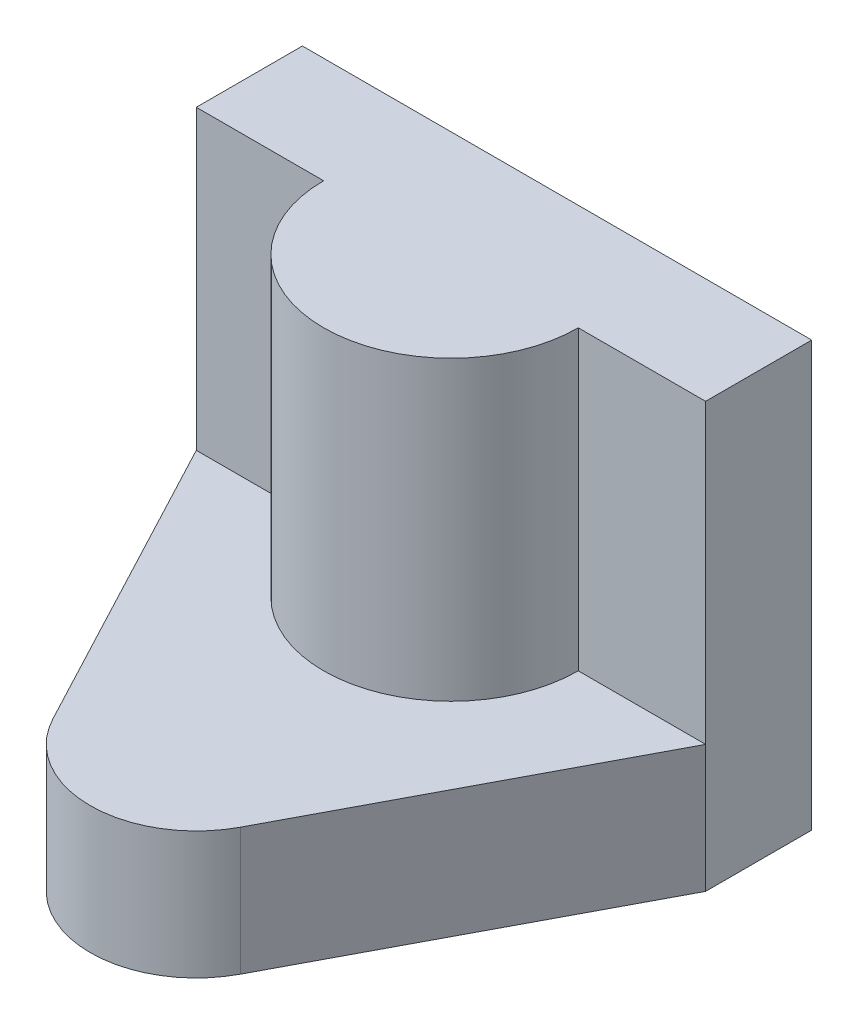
from build123d import *

# Parameters (mm, degrees)
EXTRUDE_1_DEPTH = 100
EXTRUDE_2_DEPTH = 30


with BuildPart() as part:
    # Sketch 1 → Extrude 1 (new body)
    with BuildSketch(Plane(origin=(0, 0, 0), x_dir=(1, 0, 0), z_dir=(0, 1, 0))):
        with BuildLine():
            Line((-60, 0), (60, 0))
            Line((60, 0), (60, -25))
            Line((60, -25), (30, -25))
            ThreePointArc((30, -25), (0, -55), (-30, -25))
            Line((-30, -25), (-60, -25))
            Line((-60, -25), (-60, 0))
        make_face()
    extrude(amount=EXTRUDE_1_DEPTH)

    # Sketch 1_3 → Extrude 2 (add)
    with BuildSketch(Plane(origin=(0, 0, 0), x_dir=(1, 0, 0), z_dir=(0, 1, 0))):
        with BuildLine():
            Line((-30, -25), (-60, -25))
            Line((-60, -25), (-22.101327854, -96.684661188))
            ThreePointArc((-22.101327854, -96.684661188), (0, -110), (22.101327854, -96.684661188))
            Line((22.101327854, -96.684661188), (60, -25))
            Line((60, -25), (30, -25))
            ThreePointArc((30, -25), (0, -55), (-30, -25))
        make_face()
    extrude(amount=EXTRUDE_2_DEPTH)


solid = part.part
